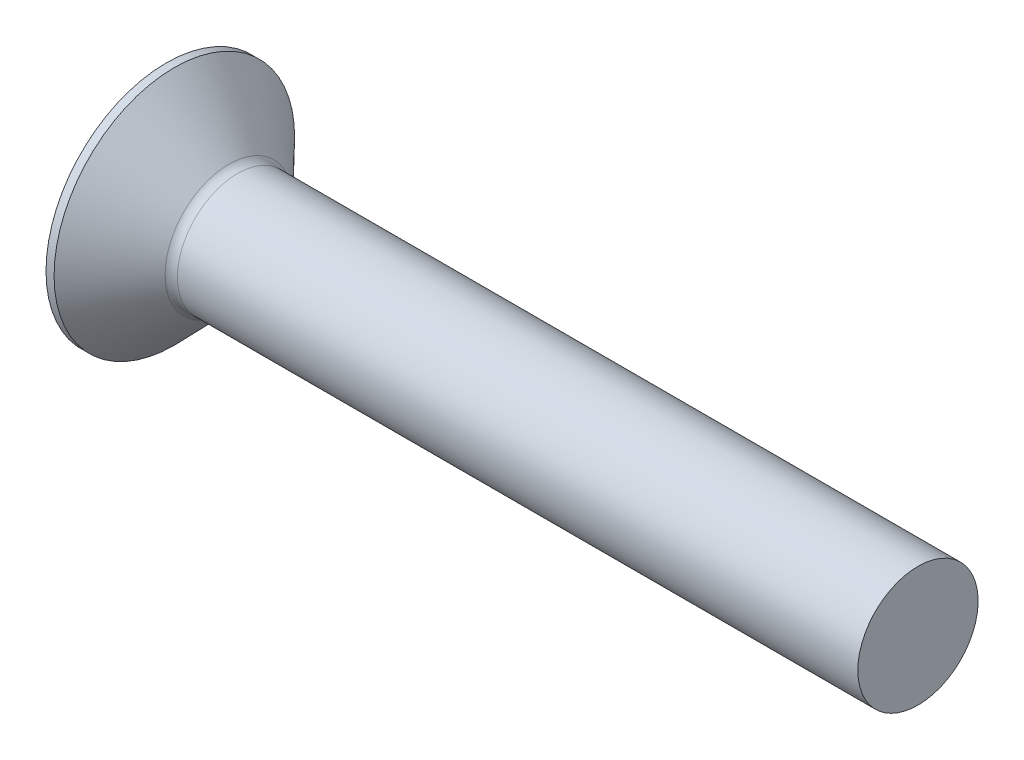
from build123d import *

# Parameters (mm, degrees)
FILLET1_R    = 0.8
RECPAT_COUNT = 2
RECPAT_ANGLE = 90


with BuildPart() as part:
    # BodySke → BaseBody (revolve)
    with BuildSketch(Plane.XY, mode=Mode.PRIVATE) as basebody_sk:
        Polygon((0, 0), (0, 8), (0.537244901, 8), (4.4, 4), (50, 4), (50, 0), align=None)
    revolve(basebody_sk.sketch.rotate(Axis((0, 0, 0), (1, 0, 0)), 90), axis=Axis((0, 0, 0), (1, 0, 0)))

    # Fillet1
    fillet1_edges = [part.edges().sort_by_distance(p)[0] for p in [
        (4.4, 0, -4),
    ]]
    fillet(fillet1_edges, radius=FILLET1_R)

    # RecSkeTop → Recess section 0
    with BuildSketch(Plane.ZY):
        with BuildLine():
            Line((-0.924, 4.2), (0.924, 4.2))
            Line((0.924, 4.2), (0.924, -4.2))
            Line((0.924, -4.2), (-0.924, -4.2))
            Line((-0.924, -4.2), (-0.924, 4.2))
        make_face()
    # RecSkeBot → Recess section 1
    with BuildSketch(Plane(origin=(4.96, 0, 0), x_dir=(0, 0, -1), z_dir=(1, 0, 0))):
        with BuildLine():
            Line((0.924, 1.727035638), (-0.924, 1.727035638))
            Line((-0.924, 1.727035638), (-0.924, -1.727035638))
            Line((-0.924, -1.727035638), (0.924, -1.727035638))
            Line((0.924, -1.727035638), (0.924, 1.727035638))
        make_face()
    recess = loft(mode=Mode.SUBTRACT)

    # RecPat: Recess ×2 about axis
    recpat_axis = Axis((0, 0, 0), (1, 0, 0))
    for i in range(1, RECPAT_COUNT):
        add(recess.rotate(recpat_axis, i * RECPAT_ANGLE / (RECPAT_COUNT - 1)), mode=Mode.SUBTRACT)

    # RecCorSke → RecessCore (revolve, cut)
    with BuildSketch(Plane.XY, mode=Mode.PRIVATE) as recesscore_sk:
        Polygon((0, 0), (0, 2.0328), (4.96, 1.685963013), (5.50780259, 0), align=None)
    revolve(recesscore_sk.sketch.rotate(Axis((0, 0, 0), (1, 0, 0)), 90), axis=Axis((0, 0, 0), (1, 0, 0)), mode=Mode.SUBTRACT)


solid = part.part
